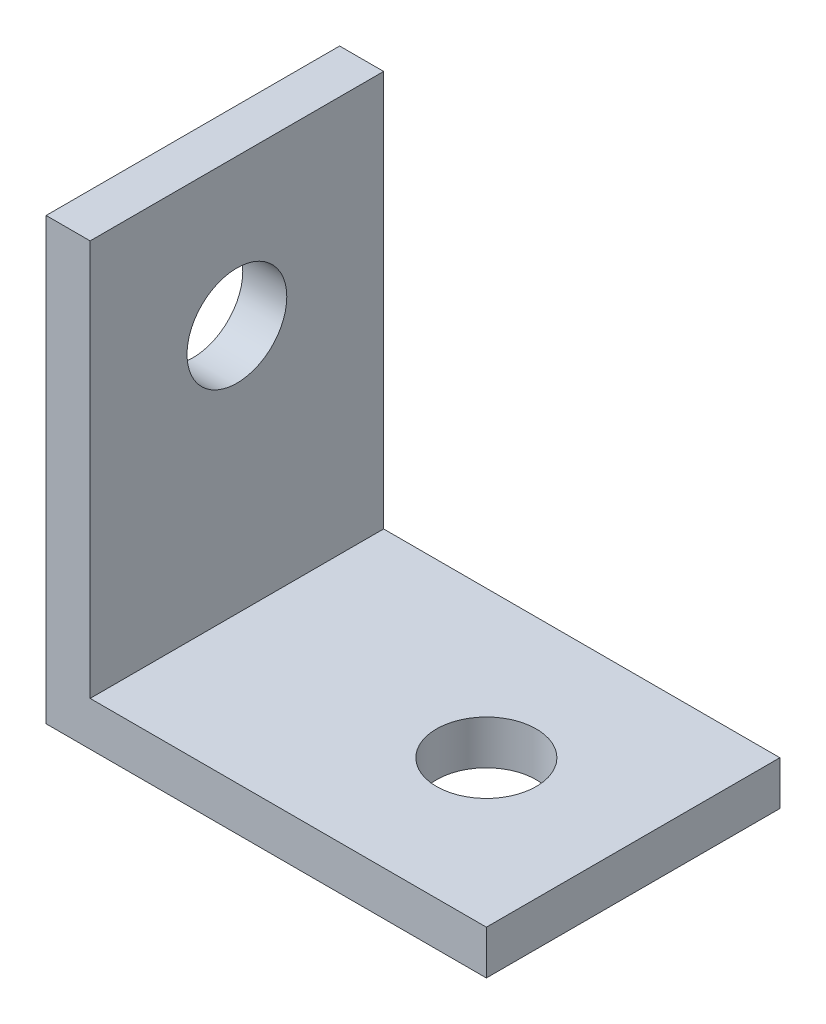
ISO-10303-21;
HEADER;
FILE_DESCRIPTION(('STEP AP214'),'2;1');
FILE_NAME('part.step','',(''),(''),'','','');
FILE_SCHEMA(('AUTOMOTIVE_DESIGN { 1 0 10303 214 1 1 1 1 }'));
ENDSEC;
DATA;
#1=APPLICATION_CONTEXT('core data for automotive mechanical design processes');
#2=APPLICATION_PROTOCOL_DEFINITION('international standard','automotive_design',2000,#1);
#3=PRODUCT_CONTEXT('',#1,'mechanical');
#4=PRODUCT('Part','Part','',(#3));
#5=PRODUCT_RELATED_PRODUCT_CATEGORY('part','',(#4));
#6=PRODUCT_DEFINITION_FORMATION('','',#4);
#7=PRODUCT_DEFINITION_CONTEXT('part definition',#1,'design');
#8=PRODUCT_DEFINITION('design','',#6,#7);
#9=PRODUCT_DEFINITION_SHAPE('','',#8);
#10=(LENGTH_UNIT() NAMED_UNIT(*) SI_UNIT(.MILLI.,.METRE.));
#11=(NAMED_UNIT(*) PLANE_ANGLE_UNIT() SI_UNIT($,.RADIAN.));
#12=(NAMED_UNIT(*) SI_UNIT($,.STERADIAN.) SOLID_ANGLE_UNIT());
#13=UNCERTAINTY_MEASURE_WITH_UNIT(LENGTH_MEASURE(1.E-05),#10,'distance_accuracy_value','');
#14=(GEOMETRIC_REPRESENTATION_CONTEXT(3) GLOBAL_UNCERTAINTY_ASSIGNED_CONTEXT((#13)) GLOBAL_UNIT_ASSIGNED_CONTEXT((#10,
#11,#12)) REPRESENTATION_CONTEXT('',''));
#15=CARTESIAN_POINT('',(0.,0.,0.));
#16=DIRECTION('',(0.,0.,1.));
#17=DIRECTION('',(1.,0.,0.));
#18=AXIS2_PLACEMENT_3D('',#15,#16,#17);
#19=CARTESIAN_POINT('',(7.5,7.5,10.));
#20=DIRECTION('',(-1.,0.,0.));
#21=DIRECTION('',(0.,-1.,0.));
#22=AXIS2_PLACEMENT_3D('',#19,#20,#21);
#23=PLANE('',#22);
#24=DIRECTION('',(0.,1.,0.));
#25=VECTOR('',#24,1.);
#26=CARTESIAN_POINT('',(7.5,7.5,0.));
#27=LINE('',#26,#25);
#28=CARTESIAN_POINT('',(7.5,-7.5,0.));
#29=VERTEX_POINT('',#28);
#30=CARTESIAN_POINT('',(7.5,-6.,0.));
#31=VERTEX_POINT('',#30);
#32=EDGE_CURVE('E116',#29,#31,#27,.T.);
#33=ORIENTED_EDGE('',*,*,#32,.T.);
#34=DIRECTION('',(0.,0.,1.));
#35=VECTOR('',#34,1.);
#36=CARTESIAN_POINT('',(7.5,-6.,10.));
#37=LINE('',#36,#35);
#38=CARTESIAN_POINT('',(7.5,-6.,10.));
#39=VERTEX_POINT('',#38);
#40=EDGE_CURVE('E48',#31,#39,#37,.T.);
#41=ORIENTED_EDGE('',*,*,#40,.T.);
#42=DIRECTION('',(0.,1.,0.));
#43=VECTOR('',#42,1.);
#44=CARTESIAN_POINT('',(7.5,7.5,10.));
#45=LINE('',#44,#43);
#46=CARTESIAN_POINT('',(7.5,-7.5,10.));
#47=VERTEX_POINT('',#46);
#48=EDGE_CURVE('E124',#47,#39,#45,.T.);
#49=ORIENTED_EDGE('',*,*,#48,.F.);
#50=DIRECTION('',(0.,0.,-1.));
#51=VECTOR('',#50,1.);
#52=CARTESIAN_POINT('',(7.5,-7.5,10.));
#53=LINE('',#52,#51);
#54=EDGE_CURVE('E125',#47,#29,#53,.T.);
#55=ORIENTED_EDGE('',*,*,#54,.T.);
#56=EDGE_LOOP('',(#33,#41,#49,#55));
#57=FACE_BOUND('',#56,.T.);
#58=ADVANCED_FACE('F34',(#57),#23,.F.);
#59=CARTESIAN_POINT('',(-7.5,7.5,10.));
#60=DIRECTION('',(0.,-1.,0.));
#61=DIRECTION('',(0.,0.,-1.));
#62=AXIS2_PLACEMENT_3D('',#59,#60,#61);
#63=PLANE('',#62);
#64=DIRECTION('',(-1.,0.,0.));
#65=VECTOR('',#64,1.);
#66=CARTESIAN_POINT('',(-7.5,7.5,10.));
#67=LINE('',#66,#65);
#68=CARTESIAN_POINT('',(-6.,7.5,10.));
#69=VERTEX_POINT('',#68);
#70=CARTESIAN_POINT('',(-7.5,7.5,10.));
#71=VERTEX_POINT('',#70);
#72=EDGE_CURVE('E79',#69,#71,#67,.T.);
#73=ORIENTED_EDGE('',*,*,#72,.F.);
#74=DIRECTION('',(0.,0.,-1.));
#75=VECTOR('',#74,1.);
#76=CARTESIAN_POINT('',(-6.,7.5,10.));
#77=LINE('',#76,#75);
#78=CARTESIAN_POINT('',(-6.,7.5,0.));
#79=VERTEX_POINT('',#78);
#80=EDGE_CURVE('E119',#69,#79,#77,.T.);
#81=ORIENTED_EDGE('',*,*,#80,.T.);
#82=DIRECTION('',(-1.,0.,0.));
#83=VECTOR('',#82,1.);
#84=CARTESIAN_POINT('',(-7.5,7.5,0.));
#85=LINE('',#84,#83);
#86=CARTESIAN_POINT('',(-7.5,7.5,0.));
#87=VERTEX_POINT('',#86);
#88=EDGE_CURVE('E112',#79,#87,#85,.T.);
#89=ORIENTED_EDGE('',*,*,#88,.T.);
#90=DIRECTION('',(0.,0.,-1.));
#91=VECTOR('',#90,1.);
#92=CARTESIAN_POINT('',(-7.5,7.5,10.));
#93=LINE('',#92,#91);
#94=EDGE_CURVE('E41',#71,#87,#93,.T.);
#95=ORIENTED_EDGE('',*,*,#94,.F.);
#96=EDGE_LOOP('',(#73,#81,#89,#95));
#97=FACE_BOUND('',#96,.T.);
#98=ADVANCED_FACE('F133',(#97),#63,.F.);
#99=CARTESIAN_POINT('',(-7.5,7.5,10.));
#100=DIRECTION('',(1.,0.,0.));
#101=DIRECTION('',(0.,1.,0.));
#102=AXIS2_PLACEMENT_3D('',#99,#100,#101);
#103=PLANE('',#102);
#104=CARTESIAN_POINT('',(-7.5,2.5,5.));
#105=DIRECTION('',(1.,0.,0.));
#106=DIRECTION('',(0.,0.,-1.));
#107=AXIS2_PLACEMENT_3D('',#104,#105,#106);
#108=CIRCLE('',#107,1.7);
#109=CARTESIAN_POINT('',(-7.5,2.5,3.3));
#110=VERTEX_POINT('',#109);
#111=EDGE_CURVE('E141',#110,#110,#108,.T.);
#112=ORIENTED_EDGE('',*,*,#111,.T.);
#113=EDGE_LOOP('',(#112));
#114=FACE_BOUND('',#113,.T.);
#115=DIRECTION('',(0.,-1.,0.));
#116=VECTOR('',#115,1.);
#117=CARTESIAN_POINT('',(-7.5,7.5,0.));
#118=LINE('',#117,#116);
#119=CARTESIAN_POINT('',(-7.5,-7.5,0.));
#120=VERTEX_POINT('',#119);
#121=EDGE_CURVE('E113',#87,#120,#118,.T.);
#122=ORIENTED_EDGE('',*,*,#121,.T.);
#123=DIRECTION('',(0.,0.,-1.));
#124=VECTOR('',#123,1.);
#125=CARTESIAN_POINT('',(-7.5,-7.5,10.));
#126=LINE('',#125,#124);
#127=CARTESIAN_POINT('',(-7.5,-7.5,10.));
#128=VERTEX_POINT('',#127);
#129=EDGE_CURVE('E127',#128,#120,#126,.T.);
#130=ORIENTED_EDGE('',*,*,#129,.F.);
#131=DIRECTION('',(0.,-1.,0.));
#132=VECTOR('',#131,1.);
#133=CARTESIAN_POINT('',(-7.5,7.5,10.));
#134=LINE('',#133,#132);
#135=EDGE_CURVE('E132',#71,#128,#134,.T.);
#136=ORIENTED_EDGE('',*,*,#135,.F.);
#137=ORIENTED_EDGE('',*,*,#94,.T.);
#138=EDGE_LOOP('',(#122,#130,#136,#137));
#139=FACE_BOUND('',#138,.T.);
#140=ADVANCED_FACE('F130',(#114,#139),#103,.F.);
#141=CARTESIAN_POINT('',(-7.5,-7.5,10.));
#142=DIRECTION('',(0.,1.,0.));
#143=DIRECTION('',(0.,0.,1.));
#144=AXIS2_PLACEMENT_3D('',#141,#142,#143);
#145=PLANE('',#144);
#146=CARTESIAN_POINT('',(2.5,-7.5,5.));
#147=DIRECTION('',(0.,1.,0.));
#148=DIRECTION('',(0.,0.,1.));
#149=AXIS2_PLACEMENT_3D('',#146,#147,#148);
#150=CIRCLE('',#149,1.7);
#151=CARTESIAN_POINT('',(2.5,-7.5,6.7));
#152=VERTEX_POINT('',#151);
#153=EDGE_CURVE('E148',#152,#152,#150,.T.);
#154=ORIENTED_EDGE('',*,*,#153,.T.);
#155=EDGE_LOOP('',(#154));
#156=FACE_BOUND('',#155,.T.);
#157=DIRECTION('',(1.,0.,0.));
#158=VECTOR('',#157,1.);
#159=CARTESIAN_POINT('',(-7.5,-7.5,0.));
#160=LINE('',#159,#158);
#161=EDGE_CURVE('E74',#120,#29,#160,.T.);
#162=ORIENTED_EDGE('',*,*,#161,.T.);
#163=ORIENTED_EDGE('',*,*,#54,.F.);
#164=DIRECTION('',(1.,0.,0.));
#165=VECTOR('',#164,1.);
#166=CARTESIAN_POINT('',(-7.5,-7.5,10.));
#167=LINE('',#166,#165);
#168=EDGE_CURVE('E57',#128,#47,#167,.T.);
#169=ORIENTED_EDGE('',*,*,#168,.F.);
#170=ORIENTED_EDGE('',*,*,#129,.T.);
#171=EDGE_LOOP('',(#162,#163,#169,#170));
#172=FACE_BOUND('',#171,.T.);
#173=ADVANCED_FACE('F174',(#156,#172),#145,.F.);
#174=CARTESIAN_POINT('',(0.,0.,10.));
#175=DIRECTION('',(0.,0.,1.));
#176=DIRECTION('',(1.,0.,0.));
#177=AXIS2_PLACEMENT_3D('',#174,#175,#176);
#178=PLANE('',#177);
#179=DIRECTION('',(0.,-1.,0.));
#180=VECTOR('',#179,1.);
#181=CARTESIAN_POINT('',(-6.,21.,10.));
#182=LINE('',#181,#180);
#183=CARTESIAN_POINT('',(-6.,-6.,10.));
#184=VERTEX_POINT('',#183);
#185=EDGE_CURVE('E99',#69,#184,#182,.T.);
#186=ORIENTED_EDGE('',*,*,#185,.F.);
#187=ORIENTED_EDGE('',*,*,#72,.T.);
#188=ORIENTED_EDGE('',*,*,#135,.T.);
#189=ORIENTED_EDGE('',*,*,#168,.T.);
#190=ORIENTED_EDGE('',*,*,#48,.T.);
#191=DIRECTION('',(1.,0.,0.));
#192=VECTOR('',#191,1.);
#193=CARTESIAN_POINT('',(21.,-6.,10.));
#194=LINE('',#193,#192);
#195=EDGE_CURVE('E107',#184,#39,#194,.T.);
#196=ORIENTED_EDGE('',*,*,#195,.F.);
#197=EDGE_LOOP('',(#186,#187,#188,#189,#190,#196));
#198=FACE_BOUND('',#197,.T.);
#199=ADVANCED_FACE('F176',(#198),#178,.T.);
#200=CARTESIAN_POINT('',(0.,0.,0.));
#201=DIRECTION('',(0.,0.,1.));
#202=DIRECTION('',(1.,0.,0.));
#203=AXIS2_PLACEMENT_3D('',#200,#201,#202);
#204=PLANE('',#203);
#205=ORIENTED_EDGE('',*,*,#88,.F.);
#206=DIRECTION('',(0.,-1.,0.));
#207=VECTOR('',#206,1.);
#208=CARTESIAN_POINT('',(-6.,0.,0.));
#209=LINE('',#208,#207);
#210=CARTESIAN_POINT('',(-6.,-6.,0.));
#211=VERTEX_POINT('',#210);
#212=EDGE_CURVE('E11',#79,#211,#209,.T.);
#213=ORIENTED_EDGE('',*,*,#212,.T.);
#214=DIRECTION('',(1.,0.,0.));
#215=VECTOR('',#214,1.);
#216=CARTESIAN_POINT('',(21.,-6.,0.));
#217=LINE('',#216,#215);
#218=EDGE_CURVE('E101',#211,#31,#217,.T.);
#219=ORIENTED_EDGE('',*,*,#218,.T.);
#220=ORIENTED_EDGE('',*,*,#32,.F.);
#221=ORIENTED_EDGE('',*,*,#161,.F.);
#222=ORIENTED_EDGE('',*,*,#121,.F.);
#223=EDGE_LOOP('',(#205,#213,#219,#220,#221,#222));
#224=FACE_BOUND('',#223,.T.);
#225=ADVANCED_FACE('F110',(#224),#204,.F.);
#226=CARTESIAN_POINT('',(-6.,21.,0.));
#227=DIRECTION('',(-1.,0.,0.));
#228=DIRECTION('',(0.,0.,1.));
#229=AXIS2_PLACEMENT_3D('',#226,#227,#228);
#230=PLANE('',#229);
#231=CARTESIAN_POINT('',(-6.,2.5,5.));
#232=DIRECTION('',(1.,0.,0.));
#233=DIRECTION('',(0.,0.,-1.));
#234=AXIS2_PLACEMENT_3D('',#231,#232,#233);
#235=CIRCLE('',#234,1.69999999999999);
#236=CARTESIAN_POINT('',(-6.,2.5,3.30000000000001));
#237=VERTEX_POINT('',#236);
#238=EDGE_CURVE('E145',#237,#237,#235,.T.);
#239=ORIENTED_EDGE('',*,*,#238,.F.);
#240=EDGE_LOOP('',(#239));
#241=FACE_BOUND('',#240,.T.);
#242=ORIENTED_EDGE('',*,*,#185,.T.);
#243=DIRECTION('',(0.,0.,1.));
#244=VECTOR('',#243,1.);
#245=CARTESIAN_POINT('',(-6.,-6.,0.));
#246=LINE('',#245,#244);
#247=EDGE_CURVE('E96',#211,#184,#246,.T.);
#248=ORIENTED_EDGE('',*,*,#247,.F.);
#249=ORIENTED_EDGE('',*,*,#212,.F.);
#250=ORIENTED_EDGE('',*,*,#80,.F.);
#251=EDGE_LOOP('',(#242,#248,#249,#250));
#252=FACE_BOUND('',#251,.T.);
#253=ADVANCED_FACE('F97',(#241,#252),#230,.F.);
#254=CARTESIAN_POINT('',(21.,-6.,0.));
#255=DIRECTION('',(0.,-1.,0.));
#256=DIRECTION('',(0.,0.,-1.));
#257=AXIS2_PLACEMENT_3D('',#254,#255,#256);
#258=PLANE('',#257);
#259=CARTESIAN_POINT('',(2.5,-6.,5.));
#260=DIRECTION('',(0.,1.,0.));
#261=DIRECTION('',(0.,0.,1.));
#262=AXIS2_PLACEMENT_3D('',#259,#260,#261);
#263=CIRCLE('',#262,1.69999999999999);
#264=CARTESIAN_POINT('',(2.5,-6.,6.69999999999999));
#265=VERTEX_POINT('',#264);
#266=EDGE_CURVE('E151',#265,#265,#263,.T.);
#267=ORIENTED_EDGE('',*,*,#266,.F.);
#268=EDGE_LOOP('',(#267));
#269=FACE_BOUND('',#268,.T.);
#270=ORIENTED_EDGE('',*,*,#218,.F.);
#271=ORIENTED_EDGE('',*,*,#247,.T.);
#272=ORIENTED_EDGE('',*,*,#195,.T.);
#273=ORIENTED_EDGE('',*,*,#40,.F.);
#274=EDGE_LOOP('',(#270,#271,#272,#273));
#275=FACE_BOUND('',#274,.T.);
#276=ADVANCED_FACE('F103',(#269,#275),#258,.F.);
#277=CARTESIAN_POINT('',(-6.,2.5,5.));
#278=DIRECTION('',(1.,0.,0.));
#279=DIRECTION('',(0.,0.,-1.));
#280=AXIS2_PLACEMENT_3D('',#277,#278,#279);
#281=CYLINDRICAL_SURFACE('',#280,1.69999999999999);
#282=ORIENTED_EDGE('',*,*,#111,.F.);
#283=EDGE_LOOP('',(#282));
#284=FACE_BOUND('',#283,.T.);
#285=ORIENTED_EDGE('',*,*,#238,.T.);
#286=EDGE_LOOP('',(#285));
#287=FACE_BOUND('',#286,.T.);
#288=ADVANCED_FACE('F158',(#284,#287),#281,.F.);
#289=CARTESIAN_POINT('',(2.5,-6.,5.));
#290=DIRECTION('',(0.,1.,0.));
#291=DIRECTION('',(0.,0.,1.));
#292=AXIS2_PLACEMENT_3D('',#289,#290,#291);
#293=CYLINDRICAL_SURFACE('',#292,1.69999999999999);
#294=ORIENTED_EDGE('',*,*,#153,.F.);
#295=EDGE_LOOP('',(#294));
#296=FACE_BOUND('',#295,.T.);
#297=ORIENTED_EDGE('',*,*,#266,.T.);
#298=EDGE_LOOP('',(#297));
#299=FACE_BOUND('',#298,.T.);
#300=ADVANCED_FACE('F155',(#296,#299),#293,.F.);
#301=CLOSED_SHELL('',(#58,#98,#140,#173,#199,#225,#253,#276,#288,#300));
#302=MANIFOLD_SOLID_BREP('B2',#301);
#303=ADVANCED_BREP_SHAPE_REPRESENTATION('',(#18,#302),#14);
#304=SHAPE_DEFINITION_REPRESENTATION(#9,#303);
ENDSEC;
END-ISO-10303-21;
